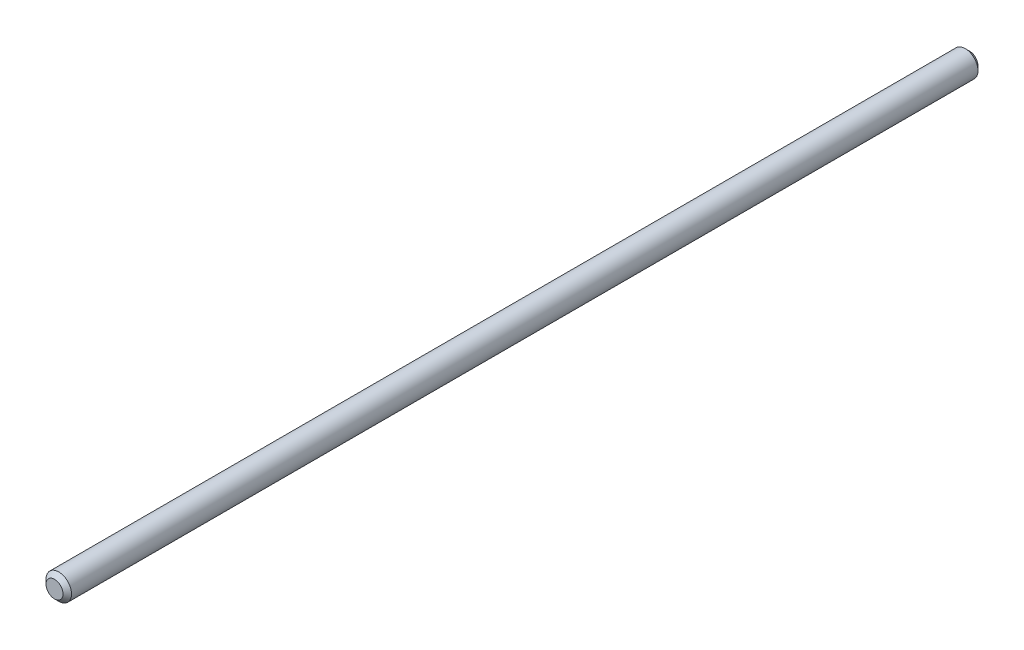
ISO-10303-21;
HEADER;
FILE_DESCRIPTION(('STEP AP214'),'2;1');
FILE_NAME('part.step','',(''),(''),'','','');
FILE_SCHEMA(('AUTOMOTIVE_DESIGN { 1 0 10303 214 1 1 1 1 }'));
ENDSEC;
DATA;
#1=APPLICATION_CONTEXT('core data for automotive mechanical design processes');
#2=APPLICATION_PROTOCOL_DEFINITION('international standard','automotive_design',2000,#1);
#3=PRODUCT_CONTEXT('',#1,'mechanical');
#4=PRODUCT('Part','Part','',(#3));
#5=PRODUCT_RELATED_PRODUCT_CATEGORY('part','',(#4));
#6=PRODUCT_DEFINITION_FORMATION('','',#4);
#7=PRODUCT_DEFINITION_CONTEXT('part definition',#1,'design');
#8=PRODUCT_DEFINITION('design','',#6,#7);
#9=PRODUCT_DEFINITION_SHAPE('','',#8);
#10=(LENGTH_UNIT() NAMED_UNIT(*) SI_UNIT(.MILLI.,.METRE.));
#11=(NAMED_UNIT(*) PLANE_ANGLE_UNIT() SI_UNIT($,.RADIAN.));
#12=(NAMED_UNIT(*) SI_UNIT($,.STERADIAN.) SOLID_ANGLE_UNIT());
#13=UNCERTAINTY_MEASURE_WITH_UNIT(LENGTH_MEASURE(1.E-05),#10,'distance_accuracy_value','');
#14=(GEOMETRIC_REPRESENTATION_CONTEXT(3) GLOBAL_UNCERTAINTY_ASSIGNED_CONTEXT((#13)) GLOBAL_UNIT_ASSIGNED_CONTEXT((#10,
#11,#12)) REPRESENTATION_CONTEXT('',''));
#15=CARTESIAN_POINT('',(0.,0.,0.));
#16=DIRECTION('',(0.,0.,1.));
#17=DIRECTION('',(1.,0.,0.));
#18=AXIS2_PLACEMENT_3D('',#15,#16,#17);
#19=CARTESIAN_POINT('',(0.,0.,215.));
#20=DIRECTION('',(0.,0.,-1.));
#21=DIRECTION('',(-1.,0.,0.));
#22=AXIS2_PLACEMENT_3D('',#19,#20,#21);
#23=CYLINDRICAL_SURFACE('',#22,3.);
#24=CARTESIAN_POINT('',(0.,0.,0.999999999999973));
#25=DIRECTION('',(0.,0.,1.));
#26=DIRECTION('',(1.,0.,0.));
#27=AXIS2_PLACEMENT_3D('',#24,#25,#26);
#28=CIRCLE('',#27,3.);
#29=CARTESIAN_POINT('',(3.,0.,0.999999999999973));
#30=VERTEX_POINT('',#29);
#31=EDGE_CURVE('E37',#30,#30,#28,.T.);
#32=ORIENTED_EDGE('',*,*,#31,.T.);
#33=EDGE_LOOP('',(#32));
#34=FACE_BOUND('',#33,.T.);
#35=CARTESIAN_POINT('',(0.,0.,214.));
#36=DIRECTION('',(0.,0.,1.));
#37=DIRECTION('',(1.,0.,0.));
#38=AXIS2_PLACEMENT_3D('',#35,#36,#37);
#39=CIRCLE('',#38,3.);
#40=CARTESIAN_POINT('',(3.,0.,214.));
#41=VERTEX_POINT('',#40);
#42=EDGE_CURVE('E41',#41,#41,#39,.F.);
#43=ORIENTED_EDGE('',*,*,#42,.T.);
#44=EDGE_LOOP('',(#43));
#45=FACE_BOUND('',#44,.T.);
#46=ADVANCED_FACE('F30',(#34,#45),#23,.T.);
#47=CARTESIAN_POINT('',(0.,0.,215.));
#48=DIRECTION('',(0.,0.,1.));
#49=DIRECTION('',(1.,0.,0.));
#50=AXIS2_PLACEMENT_3D('',#47,#48,#49);
#51=PLANE('',#50);
#52=CARTESIAN_POINT('',(0.,0.,215.));
#53=DIRECTION('',(0.,0.,1.));
#54=DIRECTION('',(1.,0.,0.));
#55=AXIS2_PLACEMENT_3D('',#52,#53,#54);
#56=CIRCLE('',#55,2.00000000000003);
#57=CARTESIAN_POINT('',(2.00000000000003,0.,215.));
#58=VERTEX_POINT('',#57);
#59=EDGE_CURVE('E45',#58,#58,#56,.T.);
#60=ORIENTED_EDGE('',*,*,#59,.T.);
#61=EDGE_LOOP('',(#60));
#62=FACE_BOUND('',#61,.T.);
#63=ADVANCED_FACE('F51',(#62),#51,.T.);
#64=CARTESIAN_POINT('',(0.,0.,0.));
#65=DIRECTION('',(0.,0.,1.));
#66=DIRECTION('',(1.,0.,0.));
#67=AXIS2_PLACEMENT_3D('',#64,#65,#66);
#68=PLANE('',#67);
#69=CARTESIAN_POINT('',(0.,0.,0.));
#70=DIRECTION('',(0.,0.,1.));
#71=DIRECTION('',(1.,0.,0.));
#72=AXIS2_PLACEMENT_3D('',#69,#70,#71);
#73=CIRCLE('',#72,2.00000000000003);
#74=CARTESIAN_POINT('',(2.00000000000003,0.,0.));
#75=VERTEX_POINT('',#74);
#76=EDGE_CURVE('E10',#75,#75,#73,.F.);
#77=ORIENTED_EDGE('',*,*,#76,.T.);
#78=EDGE_LOOP('',(#77));
#79=FACE_BOUND('',#78,.T.);
#80=ADVANCED_FACE('F55',(#79),#68,.F.);
#81=CARTESIAN_POINT('',(0.,0.,215.));
#82=DIRECTION('',(0.,0.,-1.));
#83=DIRECTION('',(-1.,0.,0.));
#84=AXIS2_PLACEMENT_3D('',#81,#82,#83);
#85=CONICAL_SURFACE('',#84,2.00000000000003,0.785398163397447);
#86=ORIENTED_EDGE('',*,*,#42,.F.);
#87=EDGE_LOOP('',(#86));
#88=FACE_BOUND('',#87,.T.);
#89=ORIENTED_EDGE('',*,*,#59,.F.);
#90=EDGE_LOOP('',(#89));
#91=FACE_BOUND('',#90,.T.);
#92=ADVANCED_FACE('F53',(#88,#91),#85,.T.);
#93=CARTESIAN_POINT('',(0.,0.,0.999999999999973));
#94=DIRECTION('',(0.,0.,1.));
#95=DIRECTION('',(1.,0.,0.));
#96=AXIS2_PLACEMENT_3D('',#93,#94,#95);
#97=CONICAL_SURFACE('',#96,3.,0.785398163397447);
#98=ORIENTED_EDGE('',*,*,#76,.F.);
#99=EDGE_LOOP('',(#98));
#100=FACE_BOUND('',#99,.T.);
#101=ORIENTED_EDGE('',*,*,#31,.F.);
#102=EDGE_LOOP('',(#101));
#103=FACE_BOUND('',#102,.T.);
#104=ADVANCED_FACE('F32',(#100,#103),#97,.T.);
#105=CLOSED_SHELL('',(#46,#63,#80,#92,#104));
#106=MANIFOLD_SOLID_BREP('B2',#105);
#107=ADVANCED_BREP_SHAPE_REPRESENTATION('',(#18,#106),#14);
#108=SHAPE_DEFINITION_REPRESENTATION(#9,#107);
ENDSEC;
END-ISO-10303-21;
